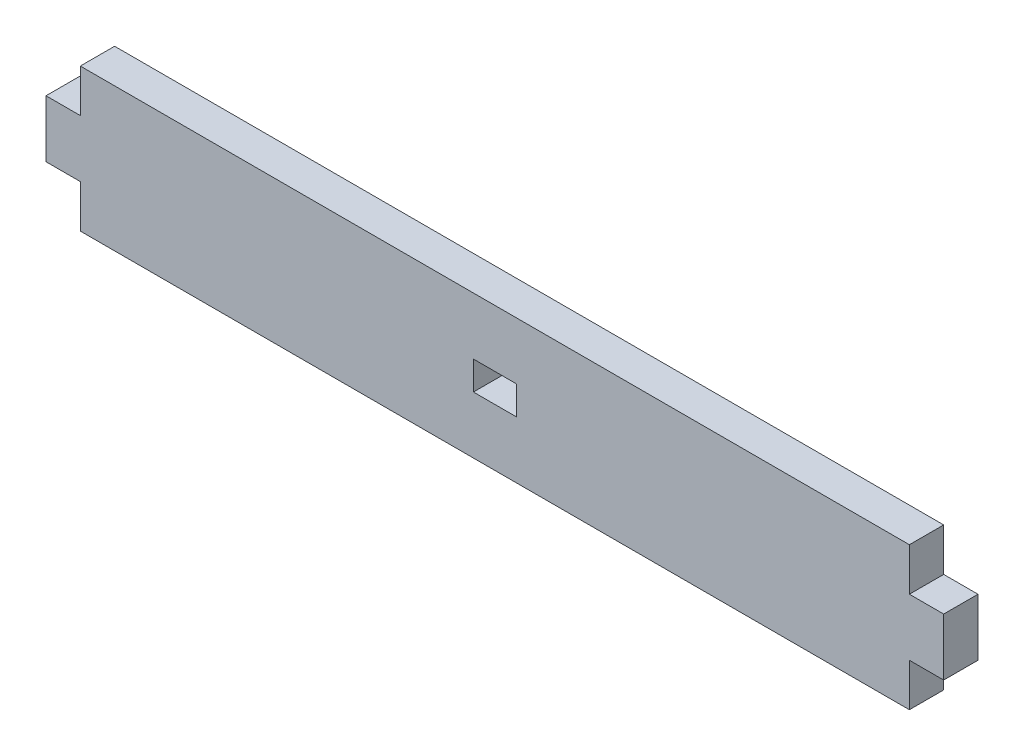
ISO-10303-21;
HEADER;
FILE_DESCRIPTION(('STEP AP214'),'2;1');
FILE_NAME('part.step','',(''),(''),'','','');
FILE_SCHEMA(('AUTOMOTIVE_DESIGN { 1 0 10303 214 1 1 1 1 }'));
ENDSEC;
DATA;
#1=APPLICATION_CONTEXT('core data for automotive mechanical design processes');
#2=APPLICATION_PROTOCOL_DEFINITION('international standard','automotive_design',2000,#1);
#3=PRODUCT_CONTEXT('',#1,'mechanical');
#4=PRODUCT('Part','Part','',(#3));
#5=PRODUCT_RELATED_PRODUCT_CATEGORY('part','',(#4));
#6=PRODUCT_DEFINITION_FORMATION('','',#4);
#7=PRODUCT_DEFINITION_CONTEXT('part definition',#1,'design');
#8=PRODUCT_DEFINITION('design','',#6,#7);
#9=PRODUCT_DEFINITION_SHAPE('','',#8);
#10=(LENGTH_UNIT() NAMED_UNIT(*) SI_UNIT(.MILLI.,.METRE.));
#11=(NAMED_UNIT(*) PLANE_ANGLE_UNIT() SI_UNIT($,.RADIAN.));
#12=(NAMED_UNIT(*) SI_UNIT($,.STERADIAN.) SOLID_ANGLE_UNIT());
#13=UNCERTAINTY_MEASURE_WITH_UNIT(LENGTH_MEASURE(1.E-05),#10,'distance_accuracy_value','');
#14=(GEOMETRIC_REPRESENTATION_CONTEXT(3) GLOBAL_UNCERTAINTY_ASSIGNED_CONTEXT((#13)) GLOBAL_UNIT_ASSIGNED_CONTEXT((#10,
#11,#12)) REPRESENTATION_CONTEXT('',''));
#15=CARTESIAN_POINT('',(0.,0.,0.));
#16=DIRECTION('',(0.,0.,1.));
#17=DIRECTION('',(1.,0.,0.));
#18=AXIS2_PLACEMENT_3D('',#15,#16,#17);
#19=CARTESIAN_POINT('',(-145.,25.,-12.));
#20=DIRECTION('',(0.,1.,0.));
#21=DIRECTION('',(0.,0.,1.));
#22=AXIS2_PLACEMENT_3D('',#19,#20,#21);
#23=PLANE('',#22);
#24=DIRECTION('',(-1.,0.,0.));
#25=VECTOR('',#24,1.);
#26=CARTESIAN_POINT('',(-145.,25.,0.));
#27=LINE('',#26,#25);
#28=CARTESIAN_POINT('',(145.,25.,0.));
#29=VERTEX_POINT('',#28);
#30=CARTESIAN_POINT('',(-145.,25.,0.));
#31=VERTEX_POINT('',#30);
#32=EDGE_CURVE('E182',#29,#31,#27,.T.);
#33=ORIENTED_EDGE('',*,*,#32,.F.);
#34=DIRECTION('',(0.,0.,1.));
#35=VECTOR('',#34,1.);
#36=CARTESIAN_POINT('',(145.,25.,-12.));
#37=LINE('',#36,#35);
#38=CARTESIAN_POINT('',(145.,25.,-12.));
#39=VERTEX_POINT('',#38);
#40=EDGE_CURVE('E11',#39,#29,#37,.T.);
#41=ORIENTED_EDGE('',*,*,#40,.F.);
#42=DIRECTION('',(-1.,0.,0.));
#43=VECTOR('',#42,1.);
#44=CARTESIAN_POINT('',(-145.,25.,-12.));
#45=LINE('',#44,#43);
#46=CARTESIAN_POINT('',(-145.,25.,-12.));
#47=VERTEX_POINT('',#46);
#48=EDGE_CURVE('E186',#39,#47,#45,.T.);
#49=ORIENTED_EDGE('',*,*,#48,.T.);
#50=DIRECTION('',(0.,0.,1.));
#51=VECTOR('',#50,1.);
#52=CARTESIAN_POINT('',(-145.,25.,-12.));
#53=LINE('',#52,#51);
#54=EDGE_CURVE('E35',#47,#31,#53,.T.);
#55=ORIENTED_EDGE('',*,*,#54,.T.);
#56=EDGE_LOOP('',(#33,#41,#49,#55));
#57=FACE_BOUND('',#56,.T.);
#58=ADVANCED_FACE('F32',(#57),#23,.T.);
#59=CARTESIAN_POINT('',(145.,25.,-12.));
#60=DIRECTION('',(1.,0.,0.));
#61=DIRECTION('',(0.,0.,-1.));
#62=AXIS2_PLACEMENT_3D('',#59,#60,#61);
#63=PLANE('',#62);
#64=DIRECTION('',(0.,1.,0.));
#65=VECTOR('',#64,1.);
#66=CARTESIAN_POINT('',(145.,25.,0.));
#67=LINE('',#66,#65);
#68=CARTESIAN_POINT('',(145.,10.,0.));
#69=VERTEX_POINT('',#68);
#70=EDGE_CURVE('E190',#69,#29,#67,.T.);
#71=ORIENTED_EDGE('',*,*,#70,.F.);
#72=DIRECTION('',(0.,0.,1.));
#73=VECTOR('',#72,1.);
#74=CARTESIAN_POINT('',(145.,10.,-12.));
#75=LINE('',#74,#73);
#76=CARTESIAN_POINT('',(145.,10.,-12.));
#77=VERTEX_POINT('',#76);
#78=EDGE_CURVE('E40',#77,#69,#75,.T.);
#79=ORIENTED_EDGE('',*,*,#78,.F.);
#80=DIRECTION('',(0.,1.,0.));
#81=VECTOR('',#80,1.);
#82=CARTESIAN_POINT('',(145.,25.,-12.));
#83=LINE('',#82,#81);
#84=EDGE_CURVE('E220',#77,#39,#83,.T.);
#85=ORIENTED_EDGE('',*,*,#84,.T.);
#86=ORIENTED_EDGE('',*,*,#40,.T.);
#87=EDGE_LOOP('',(#71,#79,#85,#86));
#88=FACE_BOUND('',#87,.T.);
#89=ADVANCED_FACE('F287',(#88),#63,.T.);
#90=CARTESIAN_POINT('',(145.,10.,-12.));
#91=DIRECTION('',(0.,1.,0.));
#92=DIRECTION('',(-1.,0.,0.));
#93=AXIS2_PLACEMENT_3D('',#90,#91,#92);
#94=PLANE('',#93);
#95=DIRECTION('',(-1.,0.,0.));
#96=VECTOR('',#95,1.);
#97=CARTESIAN_POINT('',(145.,10.,0.));
#98=LINE('',#97,#96);
#99=CARTESIAN_POINT('',(157.,9.99999999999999,0.));
#100=VERTEX_POINT('',#99);
#101=EDGE_CURVE('E252',#100,#69,#98,.T.);
#102=ORIENTED_EDGE('',*,*,#101,.F.);
#103=DIRECTION('',(0.,0.,1.));
#104=VECTOR('',#103,1.);
#105=CARTESIAN_POINT('',(157.,9.99999999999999,-12.));
#106=LINE('',#105,#104);
#107=CARTESIAN_POINT('',(157.,9.99999999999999,-12.));
#108=VERTEX_POINT('',#107);
#109=EDGE_CURVE('E258',#108,#100,#106,.T.);
#110=ORIENTED_EDGE('',*,*,#109,.F.);
#111=DIRECTION('',(-1.,0.,0.));
#112=VECTOR('',#111,1.);
#113=CARTESIAN_POINT('',(145.,10.,-12.));
#114=LINE('',#113,#112);
#115=EDGE_CURVE('E217',#108,#77,#114,.T.);
#116=ORIENTED_EDGE('',*,*,#115,.T.);
#117=ORIENTED_EDGE('',*,*,#78,.T.);
#118=EDGE_LOOP('',(#102,#110,#116,#117));
#119=FACE_BOUND('',#118,.T.);
#120=ADVANCED_FACE('F322',(#119),#94,.T.);
#121=CARTESIAN_POINT('',(157.,9.99999999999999,-12.));
#122=DIRECTION('',(1.,0.,0.));
#123=DIRECTION('',(0.,0.,-1.));
#124=AXIS2_PLACEMENT_3D('',#121,#122,#123);
#125=PLANE('',#124);
#126=DIRECTION('',(0.,1.,0.));
#127=VECTOR('',#126,1.);
#128=CARTESIAN_POINT('',(157.,9.99999999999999,0.));
#129=LINE('',#128,#127);
#130=CARTESIAN_POINT('',(157.,-10.,0.));
#131=VERTEX_POINT('',#130);
#132=EDGE_CURVE('E249',#131,#100,#129,.T.);
#133=ORIENTED_EDGE('',*,*,#132,.F.);
#134=DIRECTION('',(0.,0.,1.));
#135=VECTOR('',#134,1.);
#136=CARTESIAN_POINT('',(157.,-10.,-12.));
#137=LINE('',#136,#135);
#138=CARTESIAN_POINT('',(157.,-10.,-12.));
#139=VERTEX_POINT('',#138);
#140=EDGE_CURVE('E260',#139,#131,#137,.T.);
#141=ORIENTED_EDGE('',*,*,#140,.F.);
#142=DIRECTION('',(0.,1.,0.));
#143=VECTOR('',#142,1.);
#144=CARTESIAN_POINT('',(157.,9.99999999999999,-12.));
#145=LINE('',#144,#143);
#146=EDGE_CURVE('E214',#139,#108,#145,.T.);
#147=ORIENTED_EDGE('',*,*,#146,.T.);
#148=ORIENTED_EDGE('',*,*,#109,.T.);
#149=EDGE_LOOP('',(#133,#141,#147,#148));
#150=FACE_BOUND('',#149,.T.);
#151=ADVANCED_FACE('F319',(#150),#125,.T.);
#152=CARTESIAN_POINT('',(157.,-10.,-12.));
#153=DIRECTION('',(0.,-1.,0.));
#154=DIRECTION('',(0.,0.,-1.));
#155=AXIS2_PLACEMENT_3D('',#152,#153,#154);
#156=PLANE('',#155);
#157=DIRECTION('',(1.,0.,0.));
#158=VECTOR('',#157,1.);
#159=CARTESIAN_POINT('',(157.,-10.,0.));
#160=LINE('',#159,#158);
#161=CARTESIAN_POINT('',(145.,-10.,0.));
#162=VERTEX_POINT('',#161);
#163=EDGE_CURVE('E246',#162,#131,#160,.T.);
#164=ORIENTED_EDGE('',*,*,#163,.F.);
#165=DIRECTION('',(0.,0.,1.));
#166=VECTOR('',#165,1.);
#167=CARTESIAN_POINT('',(145.,-10.,-12.));
#168=LINE('',#167,#166);
#169=CARTESIAN_POINT('',(145.,-10.,-12.));
#170=VERTEX_POINT('',#169);
#171=EDGE_CURVE('E262',#170,#162,#168,.T.);
#172=ORIENTED_EDGE('',*,*,#171,.F.);
#173=DIRECTION('',(1.,0.,0.));
#174=VECTOR('',#173,1.);
#175=CARTESIAN_POINT('',(157.,-10.,-12.));
#176=LINE('',#175,#174);
#177=EDGE_CURVE('E211',#170,#139,#176,.T.);
#178=ORIENTED_EDGE('',*,*,#177,.T.);
#179=ORIENTED_EDGE('',*,*,#140,.T.);
#180=EDGE_LOOP('',(#164,#172,#178,#179));
#181=FACE_BOUND('',#180,.T.);
#182=ADVANCED_FACE('F316',(#181),#156,.T.);
#183=CARTESIAN_POINT('',(145.,-10.,-12.));
#184=DIRECTION('',(1.,0.,0.));
#185=DIRECTION('',(0.,0.,-1.));
#186=AXIS2_PLACEMENT_3D('',#183,#184,#185);
#187=PLANE('',#186);
#188=DIRECTION('',(0.,1.,0.));
#189=VECTOR('',#188,1.);
#190=CARTESIAN_POINT('',(145.,-10.,0.));
#191=LINE('',#190,#189);
#192=CARTESIAN_POINT('',(145.,-25.,0.));
#193=VERTEX_POINT('',#192);
#194=EDGE_CURVE('E243',#193,#162,#191,.T.);
#195=ORIENTED_EDGE('',*,*,#194,.F.);
#196=DIRECTION('',(0.,0.,1.));
#197=VECTOR('',#196,1.);
#198=CARTESIAN_POINT('',(145.,-25.,-12.));
#199=LINE('',#198,#197);
#200=CARTESIAN_POINT('',(145.,-25.,-12.));
#201=VERTEX_POINT('',#200);
#202=EDGE_CURVE('E264',#201,#193,#199,.T.);
#203=ORIENTED_EDGE('',*,*,#202,.F.);
#204=DIRECTION('',(0.,1.,0.));
#205=VECTOR('',#204,1.);
#206=CARTESIAN_POINT('',(145.,-10.,-12.));
#207=LINE('',#206,#205);
#208=EDGE_CURVE('E208',#201,#170,#207,.T.);
#209=ORIENTED_EDGE('',*,*,#208,.T.);
#210=ORIENTED_EDGE('',*,*,#171,.T.);
#211=EDGE_LOOP('',(#195,#203,#209,#210));
#212=FACE_BOUND('',#211,.T.);
#213=ADVANCED_FACE('F312',(#212),#187,.T.);
#214=CARTESIAN_POINT('',(-145.,-25.,-12.));
#215=DIRECTION('',(0.,-1.,0.));
#216=DIRECTION('',(0.,0.,-1.));
#217=AXIS2_PLACEMENT_3D('',#214,#215,#216);
#218=PLANE('',#217);
#219=DIRECTION('',(1.,0.,0.));
#220=VECTOR('',#219,1.);
#221=CARTESIAN_POINT('',(-145.,-25.,0.));
#222=LINE('',#221,#220);
#223=CARTESIAN_POINT('',(-145.,-25.,0.));
#224=VERTEX_POINT('',#223);
#225=EDGE_CURVE('E240',#224,#193,#222,.T.);
#226=ORIENTED_EDGE('',*,*,#225,.F.);
#227=DIRECTION('',(0.,0.,1.));
#228=VECTOR('',#227,1.);
#229=CARTESIAN_POINT('',(-145.,-25.,-12.));
#230=LINE('',#229,#228);
#231=CARTESIAN_POINT('',(-145.,-25.,-12.));
#232=VERTEX_POINT('',#231);
#233=EDGE_CURVE('E266',#232,#224,#230,.T.);
#234=ORIENTED_EDGE('',*,*,#233,.F.);
#235=DIRECTION('',(1.,0.,0.));
#236=VECTOR('',#235,1.);
#237=CARTESIAN_POINT('',(-145.,-25.,-12.));
#238=LINE('',#237,#236);
#239=EDGE_CURVE('E205',#232,#201,#238,.T.);
#240=ORIENTED_EDGE('',*,*,#239,.T.);
#241=ORIENTED_EDGE('',*,*,#202,.T.);
#242=EDGE_LOOP('',(#226,#234,#240,#241));
#243=FACE_BOUND('',#242,.T.);
#244=ADVANCED_FACE('F308',(#243),#218,.T.);
#245=CARTESIAN_POINT('',(-145.,-10.,-12.));
#246=DIRECTION('',(-1.,0.,0.));
#247=DIRECTION('',(0.,0.,1.));
#248=AXIS2_PLACEMENT_3D('',#245,#246,#247);
#249=PLANE('',#248);
#250=DIRECTION('',(0.,-1.,0.));
#251=VECTOR('',#250,1.);
#252=CARTESIAN_POINT('',(-145.,-10.,0.));
#253=LINE('',#252,#251);
#254=CARTESIAN_POINT('',(-145.,-10.,0.));
#255=VERTEX_POINT('',#254);
#256=EDGE_CURVE('E237',#255,#224,#253,.T.);
#257=ORIENTED_EDGE('',*,*,#256,.F.);
#258=DIRECTION('',(0.,0.,1.));
#259=VECTOR('',#258,1.);
#260=CARTESIAN_POINT('',(-145.,-10.,-12.));
#261=LINE('',#260,#259);
#262=CARTESIAN_POINT('',(-145.,-10.,-12.));
#263=VERTEX_POINT('',#262);
#264=EDGE_CURVE('E268',#263,#255,#261,.T.);
#265=ORIENTED_EDGE('',*,*,#264,.F.);
#266=DIRECTION('',(0.,-1.,0.));
#267=VECTOR('',#266,1.);
#268=CARTESIAN_POINT('',(-145.,-10.,-12.));
#269=LINE('',#268,#267);
#270=EDGE_CURVE('E202',#263,#232,#269,.T.);
#271=ORIENTED_EDGE('',*,*,#270,.T.);
#272=ORIENTED_EDGE('',*,*,#233,.T.);
#273=EDGE_LOOP('',(#257,#265,#271,#272));
#274=FACE_BOUND('',#273,.T.);
#275=ADVANCED_FACE('F304',(#274),#249,.T.);
#276=CARTESIAN_POINT('',(-157.,-10.,-12.));
#277=DIRECTION('',(0.,-1.,0.));
#278=DIRECTION('',(0.,0.,-1.));
#279=AXIS2_PLACEMENT_3D('',#276,#277,#278);
#280=PLANE('',#279);
#281=DIRECTION('',(1.,0.,0.));
#282=VECTOR('',#281,1.);
#283=CARTESIAN_POINT('',(-157.,-10.,0.));
#284=LINE('',#283,#282);
#285=CARTESIAN_POINT('',(-157.,-10.,0.));
#286=VERTEX_POINT('',#285);
#287=EDGE_CURVE('E234',#286,#255,#284,.T.);
#288=ORIENTED_EDGE('',*,*,#287,.F.);
#289=DIRECTION('',(0.,0.,1.));
#290=VECTOR('',#289,1.);
#291=CARTESIAN_POINT('',(-157.,-10.,-12.));
#292=LINE('',#291,#290);
#293=CARTESIAN_POINT('',(-157.,-10.,-12.));
#294=VERTEX_POINT('',#293);
#295=EDGE_CURVE('E270',#294,#286,#292,.T.);
#296=ORIENTED_EDGE('',*,*,#295,.F.);
#297=DIRECTION('',(1.,0.,0.));
#298=VECTOR('',#297,1.);
#299=CARTESIAN_POINT('',(-157.,-10.,-12.));
#300=LINE('',#299,#298);
#301=EDGE_CURVE('E199',#294,#263,#300,.T.);
#302=ORIENTED_EDGE('',*,*,#301,.T.);
#303=ORIENTED_EDGE('',*,*,#264,.T.);
#304=EDGE_LOOP('',(#288,#296,#302,#303));
#305=FACE_BOUND('',#304,.T.);
#306=ADVANCED_FACE('F300',(#305),#280,.T.);
#307=CARTESIAN_POINT('',(-157.,9.99999999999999,-12.));
#308=DIRECTION('',(-1.,0.,0.));
#309=DIRECTION('',(0.,0.,1.));
#310=AXIS2_PLACEMENT_3D('',#307,#308,#309);
#311=PLANE('',#310);
#312=DIRECTION('',(0.,-1.,0.));
#313=VECTOR('',#312,1.);
#314=CARTESIAN_POINT('',(-157.,9.99999999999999,0.));
#315=LINE('',#314,#313);
#316=CARTESIAN_POINT('',(-157.,9.99999999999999,0.));
#317=VERTEX_POINT('',#316);
#318=EDGE_CURVE('E231',#317,#286,#315,.T.);
#319=ORIENTED_EDGE('',*,*,#318,.F.);
#320=DIRECTION('',(0.,0.,1.));
#321=VECTOR('',#320,1.);
#322=CARTESIAN_POINT('',(-157.,9.99999999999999,-12.));
#323=LINE('',#322,#321);
#324=CARTESIAN_POINT('',(-157.,9.99999999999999,-12.));
#325=VERTEX_POINT('',#324);
#326=EDGE_CURVE('E272',#325,#317,#323,.T.);
#327=ORIENTED_EDGE('',*,*,#326,.F.);
#328=DIRECTION('',(0.,-1.,0.));
#329=VECTOR('',#328,1.);
#330=CARTESIAN_POINT('',(-157.,9.99999999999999,-12.));
#331=LINE('',#330,#329);
#332=EDGE_CURVE('E196',#325,#294,#331,.T.);
#333=ORIENTED_EDGE('',*,*,#332,.T.);
#334=ORIENTED_EDGE('',*,*,#295,.T.);
#335=EDGE_LOOP('',(#319,#327,#333,#334));
#336=FACE_BOUND('',#335,.T.);
#337=ADVANCED_FACE('F298',(#336),#311,.T.);
#338=CARTESIAN_POINT('',(-145.,10.,-12.));
#339=DIRECTION('',(0.,1.,0.));
#340=DIRECTION('',(-1.,0.,0.));
#341=AXIS2_PLACEMENT_3D('',#338,#339,#340);
#342=PLANE('',#341);
#343=DIRECTION('',(-1.,0.,0.));
#344=VECTOR('',#343,1.);
#345=CARTESIAN_POINT('',(-145.,10.,0.));
#346=LINE('',#345,#344);
#347=CARTESIAN_POINT('',(-145.,10.,0.));
#348=VERTEX_POINT('',#347);
#349=EDGE_CURVE('E228',#348,#317,#346,.T.);
#350=ORIENTED_EDGE('',*,*,#349,.F.);
#351=DIRECTION('',(0.,0.,1.));
#352=VECTOR('',#351,1.);
#353=CARTESIAN_POINT('',(-145.,10.,-12.));
#354=LINE('',#353,#352);
#355=CARTESIAN_POINT('',(-145.,10.,-12.));
#356=VERTEX_POINT('',#355);
#357=EDGE_CURVE('E273',#356,#348,#354,.T.);
#358=ORIENTED_EDGE('',*,*,#357,.F.);
#359=DIRECTION('',(-1.,0.,0.));
#360=VECTOR('',#359,1.);
#361=CARTESIAN_POINT('',(-145.,10.,-12.));
#362=LINE('',#361,#360);
#363=EDGE_CURVE('E193',#356,#325,#362,.T.);
#364=ORIENTED_EDGE('',*,*,#363,.T.);
#365=ORIENTED_EDGE('',*,*,#326,.T.);
#366=EDGE_LOOP('',(#350,#358,#364,#365));
#367=FACE_BOUND('',#366,.T.);
#368=ADVANCED_FACE('F294',(#367),#342,.T.);
#369=CARTESIAN_POINT('',(-145.,25.,-12.));
#370=DIRECTION('',(-1.,0.,0.));
#371=DIRECTION('',(0.,0.,1.));
#372=AXIS2_PLACEMENT_3D('',#369,#370,#371);
#373=PLANE('',#372);
#374=DIRECTION('',(0.,-1.,0.));
#375=VECTOR('',#374,1.);
#376=CARTESIAN_POINT('',(-145.,25.,0.));
#377=LINE('',#376,#375);
#378=EDGE_CURVE('E225',#31,#348,#377,.T.);
#379=ORIENTED_EDGE('',*,*,#378,.F.);
#380=ORIENTED_EDGE('',*,*,#54,.F.);
#381=DIRECTION('',(0.,-1.,0.));
#382=VECTOR('',#381,1.);
#383=CARTESIAN_POINT('',(-145.,25.,-12.));
#384=LINE('',#383,#382);
#385=EDGE_CURVE('E189',#47,#356,#384,.T.);
#386=ORIENTED_EDGE('',*,*,#385,.T.);
#387=ORIENTED_EDGE('',*,*,#357,.T.);
#388=EDGE_LOOP('',(#379,#380,#386,#387));
#389=FACE_BOUND('',#388,.T.);
#390=ADVANCED_FACE('F281',(#389),#373,.T.);
#391=CARTESIAN_POINT('',(0.,0.,-12.));
#392=DIRECTION('',(0.,0.,-1.));
#393=DIRECTION('',(-1.,0.,0.));
#394=AXIS2_PLACEMENT_3D('',#391,#392,#393);
#395=PLANE('',#394);
#396=CARTESIAN_POINT('',(45.,0.,-12.));
#397=DIRECTION('',(0.,0.,-1.));
#398=DIRECTION('',(-1.,0.,0.));
#399=AXIS2_PLACEMENT_3D('',#396,#397,#398);
#400=CIRCLE('',#399,4.7);
#401=CARTESIAN_POINT('',(40.3,0.,-12.));
#402=VERTEX_POINT('',#401);
#403=EDGE_CURVE('E510',#402,#402,#400,.T.);
#404=ORIENTED_EDGE('',*,*,#403,.F.);
#405=EDGE_LOOP('',(#404));
#406=FACE_BOUND('',#405,.T.);
#407=CARTESIAN_POINT('',(-45.,0.,-12.));
#408=DIRECTION('',(0.,0.,-1.));
#409=DIRECTION('',(-1.,0.,0.));
#410=AXIS2_PLACEMENT_3D('',#407,#408,#409);
#411=CIRCLE('',#410,4.69999999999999);
#412=CARTESIAN_POINT('',(-49.7,0.,-12.));
#413=VERTEX_POINT('',#412);
#414=EDGE_CURVE('E169',#413,#413,#411,.T.);
#415=ORIENTED_EDGE('',*,*,#414,.F.);
#416=EDGE_LOOP('',(#415));
#417=FACE_BOUND('',#416,.T.);
#418=DIRECTION('',(0.,-1.,0.));
#419=VECTOR('',#418,1.);
#420=CARTESIAN_POINT('',(-7.5,5.,-12.));
#421=LINE('',#420,#419);
#422=CARTESIAN_POINT('',(-7.5,5.,-12.));
#423=VERTEX_POINT('',#422);
#424=CARTESIAN_POINT('',(-7.5,-5.,-12.));
#425=VERTEX_POINT('',#424);
#426=EDGE_CURVE('E147',#423,#425,#421,.T.);
#427=ORIENTED_EDGE('',*,*,#426,.T.);
#428=DIRECTION('',(1.,0.,0.));
#429=VECTOR('',#428,1.);
#430=CARTESIAN_POINT('',(-7.5,-5.,-12.));
#431=LINE('',#430,#429);
#432=CARTESIAN_POINT('',(7.5,-5.,-12.));
#433=VERTEX_POINT('',#432);
#434=EDGE_CURVE('E156',#425,#433,#431,.T.);
#435=ORIENTED_EDGE('',*,*,#434,.T.);
#436=DIRECTION('',(0.,1.,0.));
#437=VECTOR('',#436,1.);
#438=CARTESIAN_POINT('',(7.5,5.,-12.));
#439=LINE('',#438,#437);
#440=CARTESIAN_POINT('',(7.5,5.,-12.));
#441=VERTEX_POINT('',#440);
#442=EDGE_CURVE('E48',#433,#441,#439,.T.);
#443=ORIENTED_EDGE('',*,*,#442,.T.);
#444=DIRECTION('',(-1.,0.,0.));
#445=VECTOR('',#444,1.);
#446=CARTESIAN_POINT('',(-7.5,5.,-12.));
#447=LINE('',#446,#445);
#448=EDGE_CURVE('E153',#441,#423,#447,.T.);
#449=ORIENTED_EDGE('',*,*,#448,.T.);
#450=EDGE_LOOP('',(#427,#435,#443,#449));
#451=FACE_BOUND('',#450,.T.);
#452=ORIENTED_EDGE('',*,*,#48,.F.);
#453=ORIENTED_EDGE('',*,*,#84,.F.);
#454=ORIENTED_EDGE('',*,*,#115,.F.);
#455=ORIENTED_EDGE('',*,*,#146,.F.);
#456=ORIENTED_EDGE('',*,*,#177,.F.);
#457=ORIENTED_EDGE('',*,*,#208,.F.);
#458=ORIENTED_EDGE('',*,*,#239,.F.);
#459=ORIENTED_EDGE('',*,*,#270,.F.);
#460=ORIENTED_EDGE('',*,*,#301,.F.);
#461=ORIENTED_EDGE('',*,*,#332,.F.);
#462=ORIENTED_EDGE('',*,*,#363,.F.);
#463=ORIENTED_EDGE('',*,*,#385,.F.);
#464=EDGE_LOOP('',(#452,#453,#454,#455,#456,#457,#458,#459,#460,#461,#462,#463));
#465=FACE_BOUND('',#464,.T.);
#466=ADVANCED_FACE('F160',(#406,#417,#451,#465),#395,.T.);
#467=CARTESIAN_POINT('',(0.,0.,0.));
#468=DIRECTION('',(0.,0.,-1.));
#469=DIRECTION('',(-1.,0.,0.));
#470=AXIS2_PLACEMENT_3D('',#467,#468,#469);
#471=PLANE('',#470);
#472=DIRECTION('',(1.,0.,0.));
#473=VECTOR('',#472,1.);
#474=CARTESIAN_POINT('',(-7.5,-5.,0.));
#475=LINE('',#474,#473);
#476=CARTESIAN_POINT('',(-7.5,-5.,0.));
#477=VERTEX_POINT('',#476);
#478=CARTESIAN_POINT('',(7.5,-5.,0.));
#479=VERTEX_POINT('',#478);
#480=EDGE_CURVE('E175',#477,#479,#475,.T.);
#481=ORIENTED_EDGE('',*,*,#480,.F.);
#482=DIRECTION('',(0.,-1.,0.));
#483=VECTOR('',#482,1.);
#484=CARTESIAN_POINT('',(-7.5,5.,0.));
#485=LINE('',#484,#483);
#486=CARTESIAN_POINT('',(-7.5,5.,0.));
#487=VERTEX_POINT('',#486);
#488=EDGE_CURVE('E56',#487,#477,#485,.T.);
#489=ORIENTED_EDGE('',*,*,#488,.F.);
#490=DIRECTION('',(-1.,0.,0.));
#491=VECTOR('',#490,1.);
#492=CARTESIAN_POINT('',(-7.5,5.,0.));
#493=LINE('',#492,#491);
#494=CARTESIAN_POINT('',(7.5,5.,0.));
#495=VERTEX_POINT('',#494);
#496=EDGE_CURVE('E163',#495,#487,#493,.T.);
#497=ORIENTED_EDGE('',*,*,#496,.F.);
#498=DIRECTION('',(0.,1.,0.));
#499=VECTOR('',#498,1.);
#500=CARTESIAN_POINT('',(7.5,5.,0.));
#501=LINE('',#500,#499);
#502=EDGE_CURVE('E166',#479,#495,#501,.T.);
#503=ORIENTED_EDGE('',*,*,#502,.F.);
#504=EDGE_LOOP('',(#481,#489,#497,#503));
#505=FACE_BOUND('',#504,.T.);
#506=ORIENTED_EDGE('',*,*,#32,.T.);
#507=ORIENTED_EDGE('',*,*,#378,.T.);
#508=ORIENTED_EDGE('',*,*,#349,.T.);
#509=ORIENTED_EDGE('',*,*,#318,.T.);
#510=ORIENTED_EDGE('',*,*,#287,.T.);
#511=ORIENTED_EDGE('',*,*,#256,.T.);
#512=ORIENTED_EDGE('',*,*,#225,.T.);
#513=ORIENTED_EDGE('',*,*,#194,.T.);
#514=ORIENTED_EDGE('',*,*,#163,.T.);
#515=ORIENTED_EDGE('',*,*,#132,.T.);
#516=ORIENTED_EDGE('',*,*,#101,.T.);
#517=ORIENTED_EDGE('',*,*,#70,.T.);
#518=EDGE_LOOP('',(#506,#507,#508,#509,#510,#511,#512,#513,#514,#515,#516,#517));
#519=FACE_BOUND('',#518,.T.);
#520=ADVANCED_FACE('F283',(#505,#519),#471,.F.);
#521=CARTESIAN_POINT('',(-7.5,5.,-12.));
#522=DIRECTION('',(-1.,0.,0.));
#523=DIRECTION('',(0.,0.,1.));
#524=AXIS2_PLACEMENT_3D('',#521,#522,#523);
#525=PLANE('',#524);
#526=ORIENTED_EDGE('',*,*,#488,.T.);
#527=DIRECTION('',(0.,0.,1.));
#528=VECTOR('',#527,1.);
#529=CARTESIAN_POINT('',(-7.5,-5.,-12.));
#530=LINE('',#529,#528);
#531=EDGE_CURVE('E143',#425,#477,#530,.T.);
#532=ORIENTED_EDGE('',*,*,#531,.F.);
#533=ORIENTED_EDGE('',*,*,#426,.F.);
#534=DIRECTION('',(0.,0.,1.));
#535=VECTOR('',#534,1.);
#536=CARTESIAN_POINT('',(-7.5,5.,-12.));
#537=LINE('',#536,#535);
#538=EDGE_CURVE('E180',#423,#487,#537,.T.);
#539=ORIENTED_EDGE('',*,*,#538,.T.);
#540=EDGE_LOOP('',(#526,#532,#533,#539));
#541=FACE_BOUND('',#540,.T.);
#542=ADVANCED_FACE('F145',(#541),#525,.F.);
#543=CARTESIAN_POINT('',(-7.5,5.,-12.));
#544=DIRECTION('',(0.,1.,0.));
#545=DIRECTION('',(-1.,0.,0.));
#546=AXIS2_PLACEMENT_3D('',#543,#544,#545);
#547=PLANE('',#546);
#548=ORIENTED_EDGE('',*,*,#496,.T.);
#549=ORIENTED_EDGE('',*,*,#538,.F.);
#550=ORIENTED_EDGE('',*,*,#448,.F.);
#551=DIRECTION('',(0.,0.,1.));
#552=VECTOR('',#551,1.);
#553=CARTESIAN_POINT('',(7.5,5.,-12.));
#554=LINE('',#553,#552);
#555=EDGE_CURVE('E183',#441,#495,#554,.T.);
#556=ORIENTED_EDGE('',*,*,#555,.T.);
#557=EDGE_LOOP('',(#548,#549,#550,#556));
#558=FACE_BOUND('',#557,.T.);
#559=ADVANCED_FACE('F431',(#558),#547,.F.);
#560=CARTESIAN_POINT('',(7.5,5.,-12.));
#561=DIRECTION('',(1.,0.,0.));
#562=DIRECTION('',(0.,0.,-1.));
#563=AXIS2_PLACEMENT_3D('',#560,#561,#562);
#564=PLANE('',#563);
#565=ORIENTED_EDGE('',*,*,#502,.T.);
#566=ORIENTED_EDGE('',*,*,#555,.F.);
#567=ORIENTED_EDGE('',*,*,#442,.F.);
#568=DIRECTION('',(0.,0.,1.));
#569=VECTOR('',#568,1.);
#570=CARTESIAN_POINT('',(7.5,-5.,-12.));
#571=LINE('',#570,#569);
#572=EDGE_CURVE('E152',#433,#479,#571,.T.);
#573=ORIENTED_EDGE('',*,*,#572,.T.);
#574=EDGE_LOOP('',(#565,#566,#567,#573));
#575=FACE_BOUND('',#574,.T.);
#576=ADVANCED_FACE('F440',(#575),#564,.F.);
#577=CARTESIAN_POINT('',(-7.5,-5.,-12.));
#578=DIRECTION('',(0.,-1.,0.));
#579=DIRECTION('',(1.,0.,0.));
#580=AXIS2_PLACEMENT_3D('',#577,#578,#579);
#581=PLANE('',#580);
#582=ORIENTED_EDGE('',*,*,#480,.T.);
#583=ORIENTED_EDGE('',*,*,#572,.F.);
#584=ORIENTED_EDGE('',*,*,#434,.F.);
#585=ORIENTED_EDGE('',*,*,#531,.T.);
#586=EDGE_LOOP('',(#582,#583,#584,#585));
#587=FACE_BOUND('',#586,.T.);
#588=ADVANCED_FACE('F157',(#587),#581,.F.);
#589=CARTESIAN_POINT('',(-45.,0.,-7.));
#590=DIRECTION('',(0.,0.,-1.));
#591=DIRECTION('',(-1.,0.,0.));
#592=AXIS2_PLACEMENT_3D('',#589,#590,#591);
#593=CYLINDRICAL_SURFACE('',#592,4.69999999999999);
#594=CARTESIAN_POINT('',(-45.,0.,-7.));
#595=DIRECTION('',(0.,0.,-1.));
#596=DIRECTION('',(-1.,0.,0.));
#597=AXIS2_PLACEMENT_3D('',#594,#595,#596);
#598=CIRCLE('',#597,4.69999999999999);
#599=CARTESIAN_POINT('',(-49.7,0.,-7.));
#600=VERTEX_POINT('',#599);
#601=EDGE_CURVE('E513',#600,#600,#598,.T.);
#602=ORIENTED_EDGE('',*,*,#601,.F.);
#603=EDGE_LOOP('',(#602));
#604=FACE_BOUND('',#603,.T.);
#605=ORIENTED_EDGE('',*,*,#414,.T.);
#606=EDGE_LOOP('',(#605));
#607=FACE_BOUND('',#606,.T.);
#608=ADVANCED_FACE('F458',(#604,#607),#593,.F.);
#609=CARTESIAN_POINT('',(-45.,0.,-7.));
#610=DIRECTION('',(0.,0.,-1.));
#611=DIRECTION('',(-1.,0.,0.));
#612=AXIS2_PLACEMENT_3D('',#609,#610,#611);
#613=PLANE('',#612);
#614=ORIENTED_EDGE('',*,*,#601,.T.);
#615=EDGE_LOOP('',(#614));
#616=FACE_BOUND('',#615,.T.);
#617=ADVANCED_FACE('F474',(#616),#613,.T.);
#618=CARTESIAN_POINT('',(45.,0.,-7.));
#619=DIRECTION('',(0.,0.,-1.));
#620=DIRECTION('',(-1.,0.,0.));
#621=AXIS2_PLACEMENT_3D('',#618,#619,#620);
#622=CYLINDRICAL_SURFACE('',#621,4.7);
#623=CARTESIAN_POINT('',(45.,0.,-7.));
#624=DIRECTION('',(0.,0.,-1.));
#625=DIRECTION('',(-1.,0.,0.));
#626=AXIS2_PLACEMENT_3D('',#623,#624,#625);
#627=CIRCLE('',#626,4.7);
#628=CARTESIAN_POINT('',(40.3,0.,-7.));
#629=VERTEX_POINT('',#628);
#630=EDGE_CURVE('E176',#629,#629,#627,.T.);
#631=ORIENTED_EDGE('',*,*,#630,.F.);
#632=EDGE_LOOP('',(#631));
#633=FACE_BOUND('',#632,.T.);
#634=ORIENTED_EDGE('',*,*,#403,.T.);
#635=EDGE_LOOP('',(#634));
#636=FACE_BOUND('',#635,.T.);
#637=ADVANCED_FACE('F484',(#633,#636),#622,.F.);
#638=CARTESIAN_POINT('',(45.,0.,-7.));
#639=DIRECTION('',(0.,0.,-1.));
#640=DIRECTION('',(-1.,0.,0.));
#641=AXIS2_PLACEMENT_3D('',#638,#639,#640);
#642=PLANE('',#641);
#643=ORIENTED_EDGE('',*,*,#630,.T.);
#644=EDGE_LOOP('',(#643));
#645=FACE_BOUND('',#644,.T.);
#646=ADVANCED_FACE('F494',(#645),#642,.T.);
#647=CLOSED_SHELL('',(#58,#89,#120,#151,#182,#213,#244,#275,#306,#337,#368,#390,#466,#520,#542,
#559,#576,#588,#608,#617,#637,#646));
#648=MANIFOLD_SOLID_BREP('B2',#647);
#649=ADVANCED_BREP_SHAPE_REPRESENTATION('',(#18,#648),#14);
#650=SHAPE_DEFINITION_REPRESENTATION(#9,#649);
ENDSEC;
END-ISO-10303-21;
